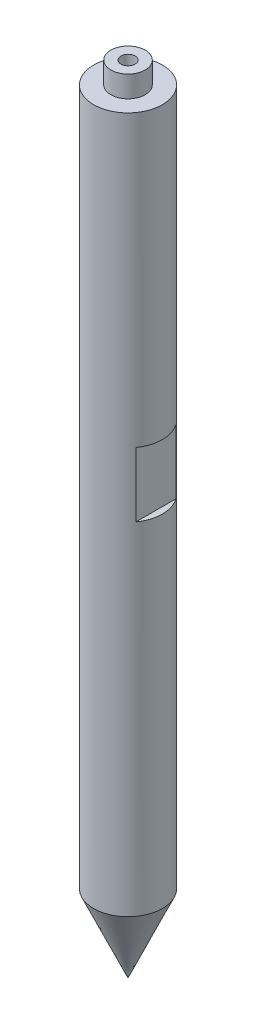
ISO-10303-21;
HEADER;
FILE_DESCRIPTION(('STEP AP214'),'2;1');
FILE_NAME('part.step','',(''),(''),'','','');
FILE_SCHEMA(('AUTOMOTIVE_DESIGN { 1 0 10303 214 1 1 1 1 }'));
ENDSEC;
DATA;
#1=APPLICATION_CONTEXT('core data for automotive mechanical design processes');
#2=APPLICATION_PROTOCOL_DEFINITION('international standard','automotive_design',2000,#1);
#3=PRODUCT_CONTEXT('',#1,'mechanical');
#4=PRODUCT('Part','Part','',(#3));
#5=PRODUCT_RELATED_PRODUCT_CATEGORY('part','',(#4));
#6=PRODUCT_DEFINITION_FORMATION('','',#4);
#7=PRODUCT_DEFINITION_CONTEXT('part definition',#1,'design');
#8=PRODUCT_DEFINITION('design','',#6,#7);
#9=PRODUCT_DEFINITION_SHAPE('','',#8);
#10=(LENGTH_UNIT() NAMED_UNIT(*) SI_UNIT(.MILLI.,.METRE.));
#11=(NAMED_UNIT(*) PLANE_ANGLE_UNIT() SI_UNIT($,.RADIAN.));
#12=(NAMED_UNIT(*) SI_UNIT($,.STERADIAN.) SOLID_ANGLE_UNIT());
#13=UNCERTAINTY_MEASURE_WITH_UNIT(LENGTH_MEASURE(1.E-05),#10,'distance_accuracy_value','');
#14=(GEOMETRIC_REPRESENTATION_CONTEXT(3) GLOBAL_UNCERTAINTY_ASSIGNED_CONTEXT((#13)) GLOBAL_UNIT_ASSIGNED_CONTEXT((#10,
#11,#12)) REPRESENTATION_CONTEXT('',''));
#15=CARTESIAN_POINT('',(0.,0.,0.));
#16=DIRECTION('',(0.,0.,1.));
#17=DIRECTION('',(1.,0.,0.));
#18=AXIS2_PLACEMENT_3D('',#15,#16,#17);
#19=CARTESIAN_POINT('',(0.,0.,0.));
#20=DIRECTION('',(0.,-1.,0.));
#21=DIRECTION('',(0.,0.,-1.));
#22=AXIS2_PLACEMENT_3D('',#19,#20,#21);
#23=PLANE('',#22);
#24=CARTESIAN_POINT('',(0.,0.,0.));
#25=DIRECTION('',(0.,1.,0.));
#26=DIRECTION('',(0.,0.,1.));
#27=AXIS2_PLACEMENT_3D('',#24,#25,#26);
#28=CIRCLE('',#27,4.);
#29=CARTESIAN_POINT('',(0.,0.,4.));
#30=VERTEX_POINT('',#29);
#31=EDGE_CURVE('E109',#30,#30,#28,.T.);
#32=ORIENTED_EDGE('',*,*,#31,.F.);
#33=EDGE_LOOP('',(#32));
#34=FACE_BOUND('',#33,.T.);
#35=CARTESIAN_POINT('',(0.,0.,0.));
#36=DIRECTION('',(0.,-1.,0.));
#37=DIRECTION('',(0.,0.,-1.));
#38=AXIS2_PLACEMENT_3D('',#35,#36,#37);
#39=CIRCLE('',#38,8.);
#40=CARTESIAN_POINT('',(0.,0.,-8.));
#41=VERTEX_POINT('',#40);
#42=EDGE_CURVE('E113',#41,#41,#39,.T.);
#43=ORIENTED_EDGE('',*,*,#42,.F.);
#44=EDGE_LOOP('',(#43));
#45=FACE_BOUND('',#44,.T.);
#46=ADVANCED_FACE('F38',(#34,#45),#23,.F.);
#47=CARTESIAN_POINT('',(0.,-180.,0.));
#48=DIRECTION('',(0.,-1.,0.));
#49=DIRECTION('',(0.,0.,-1.));
#50=AXIS2_PLACEMENT_3D('',#47,#48,#49);
#51=CYLINDRICAL_SURFACE('',#50,7.99999999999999);
#52=DIRECTION('',(0.,-1.,0.));
#53=VECTOR('',#52,1.);
#54=CARTESIAN_POINT('',(6.50000000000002,-180.,4.66368952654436));
#55=LINE('',#54,#53);
#56=CARTESIAN_POINT('',(6.50000000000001,-82.5,4.66368952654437));
#57=VERTEX_POINT('',#56);
#58=CARTESIAN_POINT('',(6.50000000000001,-67.5,4.66368952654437));
#59=VERTEX_POINT('',#58);
#60=EDGE_CURVE('E132',#57,#59,#55,.F.);
#61=ORIENTED_EDGE('',*,*,#60,.T.);
#62=CARTESIAN_POINT('',(0.,-67.5,0.));
#63=DIRECTION('',(0.,1.,0.));
#64=DIRECTION('',(0.,0.,1.));
#65=AXIS2_PLACEMENT_3D('',#62,#63,#64);
#66=CIRCLE('',#65,7.99999999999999);
#67=CARTESIAN_POINT('',(6.50000000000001,-67.5,-4.66368952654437));
#68=VERTEX_POINT('',#67);
#69=EDGE_CURVE('E11',#59,#68,#66,.T.);
#70=ORIENTED_EDGE('',*,*,#69,.T.);
#71=DIRECTION('',(0.,-1.,0.));
#72=VECTOR('',#71,1.);
#73=CARTESIAN_POINT('',(6.50000000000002,-180.,-4.66368952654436));
#74=LINE('',#73,#72);
#75=CARTESIAN_POINT('',(6.50000000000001,-82.5,-4.66368952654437));
#76=VERTEX_POINT('',#75);
#77=EDGE_CURVE('E45',#68,#76,#74,.T.);
#78=ORIENTED_EDGE('',*,*,#77,.T.);
#79=CARTESIAN_POINT('',(0.,-82.5,0.));
#80=DIRECTION('',(0.,-1.,0.));
#81=DIRECTION('',(1.,0.,0.));
#82=AXIS2_PLACEMENT_3D('',#79,#80,#81);
#83=CIRCLE('',#82,7.99999999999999);
#84=EDGE_CURVE('E129',#76,#57,#83,.T.);
#85=ORIENTED_EDGE('',*,*,#84,.T.);
#86=EDGE_LOOP('',(#61,#70,#78,#85));
#87=FACE_BOUND('',#86,.T.);
#88=CARTESIAN_POINT('',(0.,-67.5,0.));
#89=DIRECTION('',(0.,1.,0.));
#90=DIRECTION('',(-1.,0.,0.));
#91=AXIS2_PLACEMENT_3D('',#88,#89,#90);
#92=CIRCLE('',#91,7.99999999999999);
#93=CARTESIAN_POINT('',(-6.49999999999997,-67.5,-4.66368952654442));
#94=VERTEX_POINT('',#93);
#95=CARTESIAN_POINT('',(-6.49999999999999,-67.5,4.66368952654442));
#96=VERTEX_POINT('',#95);
#97=EDGE_CURVE('E120',#94,#96,#92,.T.);
#98=ORIENTED_EDGE('',*,*,#97,.T.);
#99=DIRECTION('',(0.,-1.,0.));
#100=VECTOR('',#99,1.);
#101=CARTESIAN_POINT('',(-6.49999999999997,-180.,4.66368952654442));
#102=LINE('',#101,#100);
#103=CARTESIAN_POINT('',(-6.49999999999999,-82.5,4.66368952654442));
#104=VERTEX_POINT('',#103);
#105=EDGE_CURVE('E126',#96,#104,#102,.T.);
#106=ORIENTED_EDGE('',*,*,#105,.T.);
#107=CARTESIAN_POINT('',(0.,-82.5,0.));
#108=DIRECTION('',(0.,-1.,0.));
#109=DIRECTION('',(0.,0.,-1.));
#110=AXIS2_PLACEMENT_3D('',#107,#108,#109);
#111=CIRCLE('',#110,7.99999999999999);
#112=CARTESIAN_POINT('',(-6.49999999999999,-82.5,-4.66368952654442));
#113=VERTEX_POINT('',#112);
#114=EDGE_CURVE('E123',#104,#113,#111,.T.);
#115=ORIENTED_EDGE('',*,*,#114,.T.);
#116=DIRECTION('',(0.,-1.,0.));
#117=VECTOR('',#116,1.);
#118=CARTESIAN_POINT('',(-6.49999999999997,-180.,-4.66368952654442));
#119=LINE('',#118,#117);
#120=EDGE_CURVE('E112',#113,#94,#119,.F.);
#121=ORIENTED_EDGE('',*,*,#120,.T.);
#122=EDGE_LOOP('',(#98,#106,#115,#121));
#123=FACE_BOUND('',#122,.T.);
#124=CARTESIAN_POINT('',(0.,-162.,0.));
#125=DIRECTION('',(0.,-1.,0.));
#126=DIRECTION('',(0.,0.,-1.));
#127=AXIS2_PLACEMENT_3D('',#124,#125,#126);
#128=CIRCLE('',#127,7.99999999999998);
#129=CARTESIAN_POINT('',(0.,-162.,-7.99999999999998));
#130=VERTEX_POINT('',#129);
#131=EDGE_CURVE('E108',#130,#130,#128,.T.);
#132=ORIENTED_EDGE('',*,*,#131,.F.);
#133=EDGE_LOOP('',(#132));
#134=FACE_BOUND('',#133,.T.);
#135=ORIENTED_EDGE('',*,*,#42,.T.);
#136=EDGE_LOOP('',(#135));
#137=FACE_BOUND('',#136,.T.);
#138=ADVANCED_FACE('F136',(#87,#123,#134,#137),#51,.T.);
#139=CARTESIAN_POINT('',(0.,-162.,0.));
#140=DIRECTION('',(0.,1.,0.));
#141=DIRECTION('',(0.,0.,1.));
#142=AXIS2_PLACEMENT_3D('',#139,#140,#141);
#143=CONICAL_SURFACE('',#142,7.99999999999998,0.418224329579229);
#144=CARTESIAN_POINT('',(0.,-180.,0.));
#145=VERTEX_POINT('',#144);
#146=VERTEX_LOOP('',#145);
#147=FACE_BOUND('',#146,.T.);
#148=ORIENTED_EDGE('',*,*,#131,.T.);
#149=EDGE_LOOP('',(#148));
#150=FACE_BOUND('',#149,.T.);
#151=ADVANCED_FACE('F157',(#147,#150),#143,.T.);
#152=CARTESIAN_POINT('',(0.,5.,0.));
#153=DIRECTION('',(0.,-1.,0.));
#154=DIRECTION('',(0.,0.,-1.));
#155=AXIS2_PLACEMENT_3D('',#152,#153,#154);
#156=CYLINDRICAL_SURFACE('',#155,4.);
#157=CARTESIAN_POINT('',(0.,5.,0.));
#158=DIRECTION('',(0.,1.,0.));
#159=DIRECTION('',(0.,0.,1.));
#160=AXIS2_PLACEMENT_3D('',#157,#158,#159);
#161=CIRCLE('',#160,4.);
#162=CARTESIAN_POINT('',(0.,5.,4.));
#163=VERTEX_POINT('',#162);
#164=EDGE_CURVE('E103',#163,#163,#161,.T.);
#165=ORIENTED_EDGE('',*,*,#164,.F.);
#166=EDGE_LOOP('',(#165));
#167=FACE_BOUND('',#166,.T.);
#168=ORIENTED_EDGE('',*,*,#31,.T.);
#169=EDGE_LOOP('',(#168));
#170=FACE_BOUND('',#169,.T.);
#171=ADVANCED_FACE('F163',(#167,#170),#156,.T.);
#172=CARTESIAN_POINT('',(0.,5.,0.));
#173=DIRECTION('',(0.,1.,0.));
#174=DIRECTION('',(0.,0.,1.));
#175=AXIS2_PLACEMENT_3D('',#172,#173,#174);
#176=PLANE('',#175);
#177=CARTESIAN_POINT('',(0.,5.,0.));
#178=DIRECTION('',(0.,1.,0.));
#179=DIRECTION('',(0.,0.,1.));
#180=AXIS2_PLACEMENT_3D('',#177,#178,#179);
#181=CIRCLE('',#180,1.65);
#182=CARTESIAN_POINT('',(0.,5.,1.65));
#183=VERTEX_POINT('',#182);
#184=EDGE_CURVE('E93',#183,#183,#181,.T.);
#185=ORIENTED_EDGE('',*,*,#184,.F.);
#186=EDGE_LOOP('',(#185));
#187=FACE_BOUND('',#186,.T.);
#188=ORIENTED_EDGE('',*,*,#164,.T.);
#189=EDGE_LOOP('',(#188));
#190=FACE_BOUND('',#189,.T.);
#191=ADVANCED_FACE('F165',(#187,#190),#176,.T.);
#192=CARTESIAN_POINT('',(-6.49999999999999,-82.5,-8.));
#193=DIRECTION('',(0.,-1.,0.));
#194=DIRECTION('',(0.,0.,-1.));
#195=AXIS2_PLACEMENT_3D('',#192,#193,#194);
#196=PLANE('',#195);
#197=DIRECTION('',(0.,0.,1.));
#198=VECTOR('',#197,1.);
#199=CARTESIAN_POINT('',(-6.49999999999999,-82.5,-8.));
#200=LINE('',#199,#198);
#201=EDGE_CURVE('E92',#113,#104,#200,.T.);
#202=ORIENTED_EDGE('',*,*,#201,.F.);
#203=ORIENTED_EDGE('',*,*,#114,.F.);
#204=EDGE_LOOP('',(#202,#203));
#205=FACE_BOUND('',#204,.T.);
#206=ADVANCED_FACE('F172',(#205),#196,.F.);
#207=CARTESIAN_POINT('',(-6.49999999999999,-67.5,-8.));
#208=DIRECTION('',(0.,1.,0.));
#209=DIRECTION('',(-1.,0.,0.));
#210=AXIS2_PLACEMENT_3D('',#207,#208,#209);
#211=PLANE('',#210);
#212=DIRECTION('',(0.,0.,1.));
#213=VECTOR('',#212,1.);
#214=CARTESIAN_POINT('',(-6.49999999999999,-67.5,-8.));
#215=LINE('',#214,#213);
#216=EDGE_CURVE('E59',#94,#96,#215,.T.);
#217=ORIENTED_EDGE('',*,*,#216,.T.);
#218=ORIENTED_EDGE('',*,*,#97,.F.);
#219=EDGE_LOOP('',(#217,#218));
#220=FACE_BOUND('',#219,.T.);
#221=ADVANCED_FACE('F181',(#220),#211,.F.);
#222=CARTESIAN_POINT('',(-6.49999999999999,-67.5,-8.));
#223=DIRECTION('',(1.,0.,0.));
#224=DIRECTION('',(0.,1.,0.));
#225=AXIS2_PLACEMENT_3D('',#222,#223,#224);
#226=PLANE('',#225);
#227=ORIENTED_EDGE('',*,*,#216,.F.);
#228=ORIENTED_EDGE('',*,*,#120,.F.);
#229=ORIENTED_EDGE('',*,*,#201,.T.);
#230=ORIENTED_EDGE('',*,*,#105,.F.);
#231=EDGE_LOOP('',(#227,#228,#229,#230));
#232=FACE_BOUND('',#231,.T.);
#233=ADVANCED_FACE('F150',(#232),#226,.F.);
#234=CARTESIAN_POINT('',(6.50000000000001,-67.5,-8.));
#235=DIRECTION('',(-1.,0.,0.));
#236=DIRECTION('',(0.,-1.,0.));
#237=AXIS2_PLACEMENT_3D('',#234,#235,#236);
#238=PLANE('',#237);
#239=DIRECTION('',(0.,0.,1.));
#240=VECTOR('',#239,1.);
#241=CARTESIAN_POINT('',(6.50000000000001,-67.5,-8.));
#242=LINE('',#241,#240);
#243=EDGE_CURVE('E100',#68,#59,#242,.T.);
#244=ORIENTED_EDGE('',*,*,#243,.T.);
#245=ORIENTED_EDGE('',*,*,#60,.F.);
#246=DIRECTION('',(0.,0.,1.));
#247=VECTOR('',#246,1.);
#248=CARTESIAN_POINT('',(6.50000000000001,-82.5,-8.));
#249=LINE('',#248,#247);
#250=EDGE_CURVE('E51',#76,#57,#249,.T.);
#251=ORIENTED_EDGE('',*,*,#250,.F.);
#252=ORIENTED_EDGE('',*,*,#77,.F.);
#253=EDGE_LOOP('',(#244,#245,#251,#252));
#254=FACE_BOUND('',#253,.T.);
#255=ADVANCED_FACE('F140',(#254),#238,.F.);
#256=CARTESIAN_POINT('',(6.50000000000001,-67.5,-8.));
#257=DIRECTION('',(0.,1.,0.));
#258=DIRECTION('',(0.,0.,1.));
#259=AXIS2_PLACEMENT_3D('',#256,#257,#258);
#260=PLANE('',#259);
#261=ORIENTED_EDGE('',*,*,#243,.F.);
#262=ORIENTED_EDGE('',*,*,#69,.F.);
#263=EDGE_LOOP('',(#261,#262));
#264=FACE_BOUND('',#263,.T.);
#265=ADVANCED_FACE('F142',(#264),#260,.F.);
#266=CARTESIAN_POINT('',(6.50000000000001,-82.5,-8.));
#267=DIRECTION('',(0.,-1.,0.));
#268=DIRECTION('',(1.,0.,0.));
#269=AXIS2_PLACEMENT_3D('',#266,#267,#268);
#270=PLANE('',#269);
#271=ORIENTED_EDGE('',*,*,#250,.T.);
#272=ORIENTED_EDGE('',*,*,#84,.F.);
#273=EDGE_LOOP('',(#271,#272));
#274=FACE_BOUND('',#273,.T.);
#275=ADVANCED_FACE('F86',(#274),#270,.F.);
#276=CARTESIAN_POINT('',(0.,-5.1,0.));
#277=DIRECTION('',(0.,1.,0.));
#278=DIRECTION('',(0.,0.,1.));
#279=AXIS2_PLACEMENT_3D('',#276,#277,#278);
#280=CONICAL_SURFACE('',#279,1.65,1.02974425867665);
#281=CARTESIAN_POINT('',(0.,-6.09142002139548,0.));
#282=VERTEX_POINT('',#281);
#283=VERTEX_LOOP('',#282);
#284=FACE_BOUND('',#283,.T.);
#285=CARTESIAN_POINT('',(0.,-5.1,0.));
#286=DIRECTION('',(0.,1.,0.));
#287=DIRECTION('',(0.,0.,1.));
#288=AXIS2_PLACEMENT_3D('',#285,#286,#287);
#289=CIRCLE('',#288,1.65);
#290=CARTESIAN_POINT('',(0.,-5.1,1.65));
#291=VERTEX_POINT('',#290);
#292=EDGE_CURVE('E90',#291,#291,#289,.T.);
#293=ORIENTED_EDGE('',*,*,#292,.T.);
#294=EDGE_LOOP('',(#293));
#295=FACE_BOUND('',#294,.T.);
#296=ADVANCED_FACE('F82',(#284,#295),#280,.F.);
#297=CARTESIAN_POINT('',(0.,5.,0.));
#298=DIRECTION('',(0.,1.,0.));
#299=DIRECTION('',(0.,0.,1.));
#300=AXIS2_PLACEMENT_3D('',#297,#298,#299);
#301=CYLINDRICAL_SURFACE('',#300,1.65);
#302=ORIENTED_EDGE('',*,*,#292,.F.);
#303=EDGE_LOOP('',(#302));
#304=FACE_BOUND('',#303,.T.);
#305=ORIENTED_EDGE('',*,*,#184,.T.);
#306=EDGE_LOOP('',(#305));
#307=FACE_BOUND('',#306,.T.);
#308=ADVANCED_FACE('F85',(#304,#307),#301,.F.);
#309=CLOSED_SHELL('',(#46,#138,#151,#171,#191,#206,#221,#233,#255,#265,#275,#296,#308));
#310=MANIFOLD_SOLID_BREP('B2',#309);
#311=ADVANCED_BREP_SHAPE_REPRESENTATION('',(#18,#310),#14);
#312=SHAPE_DEFINITION_REPRESENTATION(#9,#311);
ENDSEC;
END-ISO-10303-21;
